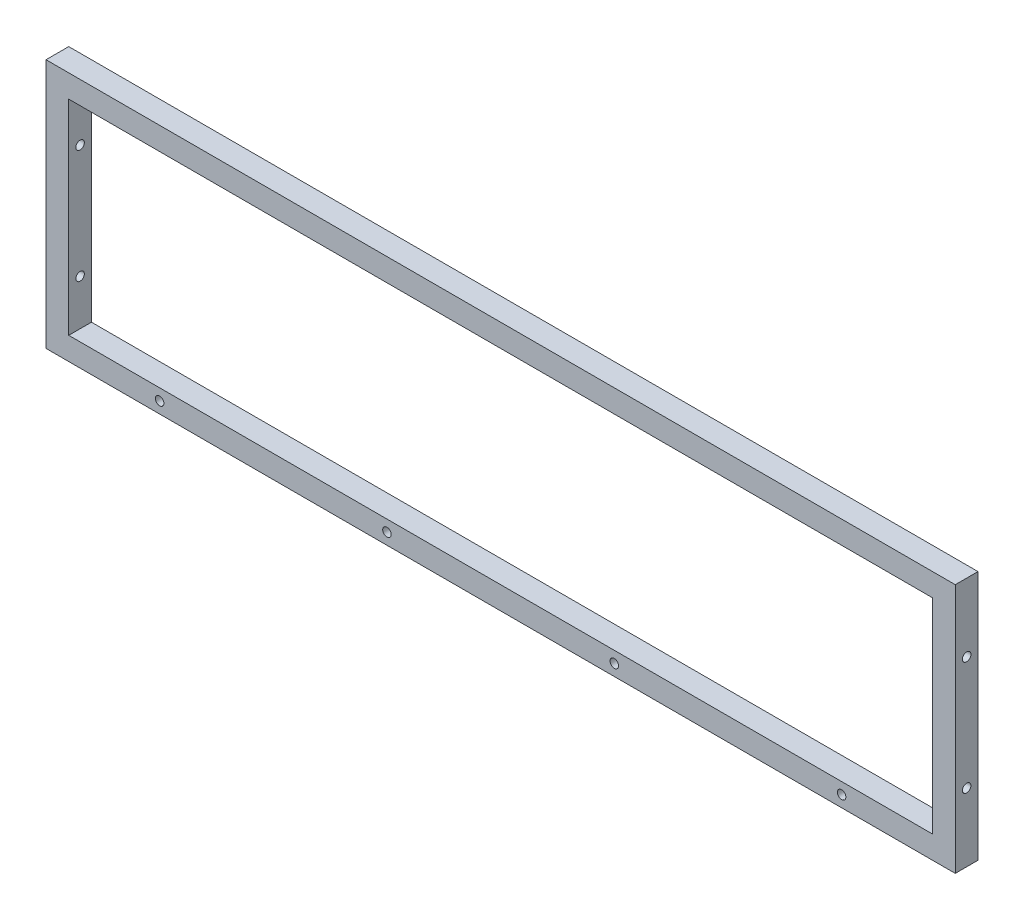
ISO-10303-21;
HEADER;
FILE_DESCRIPTION(('STEP AP214'),'2;1');
FILE_NAME('part.step','',(''),(''),'','','');
FILE_SCHEMA(('AUTOMOTIVE_DESIGN { 1 0 10303 214 1 1 1 1 }'));
ENDSEC;
DATA;
#1=APPLICATION_CONTEXT('core data for automotive mechanical design processes');
#2=APPLICATION_PROTOCOL_DEFINITION('international standard','automotive_design',2000,#1);
#3=PRODUCT_CONTEXT('',#1,'mechanical');
#4=PRODUCT('Part','Part','',(#3));
#5=PRODUCT_RELATED_PRODUCT_CATEGORY('part','',(#4));
#6=PRODUCT_DEFINITION_FORMATION('','',#4);
#7=PRODUCT_DEFINITION_CONTEXT('part definition',#1,'design');
#8=PRODUCT_DEFINITION('design','',#6,#7);
#9=PRODUCT_DEFINITION_SHAPE('','',#8);
#10=(LENGTH_UNIT() NAMED_UNIT(*) SI_UNIT(.MILLI.,.METRE.));
#11=(NAMED_UNIT(*) PLANE_ANGLE_UNIT() SI_UNIT($,.RADIAN.));
#12=(NAMED_UNIT(*) SI_UNIT($,.STERADIAN.) SOLID_ANGLE_UNIT());
#13=UNCERTAINTY_MEASURE_WITH_UNIT(LENGTH_MEASURE(1.E-05),#10,'distance_accuracy_value','');
#14=(GEOMETRIC_REPRESENTATION_CONTEXT(3) GLOBAL_UNCERTAINTY_ASSIGNED_CONTEXT((#13)) GLOBAL_UNIT_ASSIGNED_CONTEXT((#10,
#11,#12)) REPRESENTATION_CONTEXT('',''));
#15=CARTESIAN_POINT('',(0.,0.,0.));
#16=DIRECTION('',(0.,0.,1.));
#17=DIRECTION('',(1.,0.,0.));
#18=AXIS2_PLACEMENT_3D('',#15,#16,#17);
#19=CARTESIAN_POINT('',(0.,0.,25.4));
#20=DIRECTION('',(0.,0.,1.));
#21=DIRECTION('',(1.,0.,0.));
#22=AXIS2_PLACEMENT_3D('',#19,#20,#21);
#23=PLANE('',#22);
#24=CARTESIAN_POINT('',(381.,-127.,25.4));
#25=DIRECTION('',(0.,0.,1.));
#26=DIRECTION('',(1.,0.,0.));
#27=AXIS2_PLACEMENT_3D('',#24,#25,#26);
#28=CIRCLE('',#27,4.7625);
#29=CARTESIAN_POINT('',(385.7625,-127.,25.4));
#30=VERTEX_POINT('',#29);
#31=EDGE_CURVE('E171',#30,#30,#28,.T.);
#32=ORIENTED_EDGE('',*,*,#31,.F.);
#33=EDGE_LOOP('',(#32));
#34=FACE_BOUND('',#33,.T.);
#35=CARTESIAN_POINT('',(127.,-127.,25.4));
#36=DIRECTION('',(0.,0.,1.));
#37=DIRECTION('',(1.,0.,0.));
#38=AXIS2_PLACEMENT_3D('',#35,#36,#37);
#39=CIRCLE('',#38,4.76249999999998);
#40=CARTESIAN_POINT('',(131.7625,-127.,25.4));
#41=VERTEX_POINT('',#40);
#42=EDGE_CURVE('E189',#41,#41,#39,.T.);
#43=ORIENTED_EDGE('',*,*,#42,.F.);
#44=EDGE_LOOP('',(#43));
#45=FACE_BOUND('',#44,.T.);
#46=CARTESIAN_POINT('',(-381.,-127.,25.4));
#47=DIRECTION('',(0.,0.,1.));
#48=DIRECTION('',(1.,0.,0.));
#49=AXIS2_PLACEMENT_3D('',#46,#47,#48);
#50=CIRCLE('',#49,4.7625);
#51=CARTESIAN_POINT('',(-376.2375,-127.,25.4));
#52=VERTEX_POINT('',#51);
#53=EDGE_CURVE('E195',#52,#52,#50,.T.);
#54=ORIENTED_EDGE('',*,*,#53,.F.);
#55=EDGE_LOOP('',(#54));
#56=FACE_BOUND('',#55,.T.);
#57=CARTESIAN_POINT('',(-127.,-127.,25.4));
#58=DIRECTION('',(0.,0.,1.));
#59=DIRECTION('',(1.,0.,0.));
#60=AXIS2_PLACEMENT_3D('',#57,#58,#59);
#61=CIRCLE('',#60,4.76249999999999);
#62=CARTESIAN_POINT('',(-122.2375,-127.,25.4));
#63=VERTEX_POINT('',#62);
#64=EDGE_CURVE('E201',#63,#63,#61,.T.);
#65=ORIENTED_EDGE('',*,*,#64,.F.);
#66=EDGE_LOOP('',(#65));
#67=FACE_BOUND('',#66,.T.);
#68=DIRECTION('',(0.,-1.,0.));
#69=VECTOR('',#68,1.);
#70=CARTESIAN_POINT('',(-508.,-139.7,25.4));
#71=LINE('',#70,#69);
#72=CARTESIAN_POINT('',(-508.,139.7,25.4));
#73=VERTEX_POINT('',#72);
#74=CARTESIAN_POINT('',(-508.,-139.7,25.4));
#75=VERTEX_POINT('',#74);
#76=EDGE_CURVE('E140',#73,#75,#71,.T.);
#77=ORIENTED_EDGE('',*,*,#76,.T.);
#78=DIRECTION('',(1.,0.,0.));
#79=VECTOR('',#78,1.);
#80=CARTESIAN_POINT('',(508.,-139.7,25.4));
#81=LINE('',#80,#79);
#82=CARTESIAN_POINT('',(508.,-139.7,25.4));
#83=VERTEX_POINT('',#82);
#84=EDGE_CURVE('E143',#75,#83,#81,.T.);
#85=ORIENTED_EDGE('',*,*,#84,.T.);
#86=DIRECTION('',(0.,1.,0.));
#87=VECTOR('',#86,1.);
#88=CARTESIAN_POINT('',(508.,-139.7,25.4));
#89=LINE('',#88,#87);
#90=CARTESIAN_POINT('',(508.,139.7,25.4));
#91=VERTEX_POINT('',#90);
#92=EDGE_CURVE('E146',#83,#91,#89,.T.);
#93=ORIENTED_EDGE('',*,*,#92,.T.);
#94=DIRECTION('',(-1.,0.,0.));
#95=VECTOR('',#94,1.);
#96=CARTESIAN_POINT('',(508.,139.7,25.4));
#97=LINE('',#96,#95);
#98=EDGE_CURVE('E148',#91,#73,#97,.T.);
#99=ORIENTED_EDGE('',*,*,#98,.T.);
#100=EDGE_LOOP('',(#77,#85,#93,#99));
#101=FACE_BOUND('',#100,.T.);
#102=DIRECTION('',(1.,0.,0.));
#103=VECTOR('',#102,1.);
#104=CARTESIAN_POINT('',(482.6,-114.3,25.4));
#105=LINE('',#104,#103);
#106=CARTESIAN_POINT('',(-482.6,-114.3,25.4));
#107=VERTEX_POINT('',#106);
#108=CARTESIAN_POINT('',(482.6,-114.3,25.4));
#109=VERTEX_POINT('',#108);
#110=EDGE_CURVE('E110',#107,#109,#105,.T.);
#111=ORIENTED_EDGE('',*,*,#110,.F.);
#112=DIRECTION('',(0.,-1.,0.));
#113=VECTOR('',#112,1.);
#114=CARTESIAN_POINT('',(-482.6,-114.3,25.4));
#115=LINE('',#114,#113);
#116=CARTESIAN_POINT('',(-482.6,114.3,25.4));
#117=VERTEX_POINT('',#116);
#118=EDGE_CURVE('E102',#117,#107,#115,.T.);
#119=ORIENTED_EDGE('',*,*,#118,.F.);
#120=DIRECTION('',(-1.,0.,0.));
#121=VECTOR('',#120,1.);
#122=CARTESIAN_POINT('',(482.6,114.3,25.4));
#123=LINE('',#122,#121);
#124=CARTESIAN_POINT('',(482.6,114.3,25.4));
#125=VERTEX_POINT('',#124);
#126=EDGE_CURVE('E124',#125,#117,#123,.T.);
#127=ORIENTED_EDGE('',*,*,#126,.F.);
#128=DIRECTION('',(0.,1.,0.));
#129=VECTOR('',#128,1.);
#130=CARTESIAN_POINT('',(482.6,-114.3,25.4));
#131=LINE('',#130,#129);
#132=EDGE_CURVE('E122',#109,#125,#131,.T.);
#133=ORIENTED_EDGE('',*,*,#132,.F.);
#134=EDGE_LOOP('',(#111,#119,#127,#133));
#135=FACE_BOUND('',#134,.T.);
#136=ADVANCED_FACE('F35',(#34,#45,#56,#67,#101,#135),#23,.T.);
#137=CARTESIAN_POINT('',(0.,0.,0.));
#138=DIRECTION('',(0.,0.,1.));
#139=DIRECTION('',(1.,0.,0.));
#140=AXIS2_PLACEMENT_3D('',#137,#138,#139);
#141=PLANE('',#140);
#142=CARTESIAN_POINT('',(381.,-127.,0.));
#143=DIRECTION('',(0.,0.,1.));
#144=DIRECTION('',(1.,0.,0.));
#145=AXIS2_PLACEMENT_3D('',#142,#143,#144);
#146=CIRCLE('',#145,4.7625);
#147=CARTESIAN_POINT('',(385.7625,-127.,0.));
#148=VERTEX_POINT('',#147);
#149=EDGE_CURVE('E186',#148,#148,#146,.T.);
#150=ORIENTED_EDGE('',*,*,#149,.T.);
#151=EDGE_LOOP('',(#150));
#152=FACE_BOUND('',#151,.T.);
#153=CARTESIAN_POINT('',(127.,-127.,0.));
#154=DIRECTION('',(0.,0.,1.));
#155=DIRECTION('',(1.,0.,0.));
#156=AXIS2_PLACEMENT_3D('',#153,#154,#155);
#157=CIRCLE('',#156,4.7625);
#158=CARTESIAN_POINT('',(131.7625,-127.,0.));
#159=VERTEX_POINT('',#158);
#160=EDGE_CURVE('E192',#159,#159,#157,.T.);
#161=ORIENTED_EDGE('',*,*,#160,.T.);
#162=EDGE_LOOP('',(#161));
#163=FACE_BOUND('',#162,.T.);
#164=CARTESIAN_POINT('',(-381.,-127.,0.));
#165=DIRECTION('',(0.,0.,1.));
#166=DIRECTION('',(1.,0.,0.));
#167=AXIS2_PLACEMENT_3D('',#164,#165,#166);
#168=CIRCLE('',#167,4.7625);
#169=CARTESIAN_POINT('',(-376.2375,-127.,0.));
#170=VERTEX_POINT('',#169);
#171=EDGE_CURVE('E198',#170,#170,#168,.T.);
#172=ORIENTED_EDGE('',*,*,#171,.T.);
#173=EDGE_LOOP('',(#172));
#174=FACE_BOUND('',#173,.T.);
#175=CARTESIAN_POINT('',(-127.,-127.,0.));
#176=DIRECTION('',(0.,0.,1.));
#177=DIRECTION('',(1.,0.,0.));
#178=AXIS2_PLACEMENT_3D('',#175,#176,#177);
#179=CIRCLE('',#178,4.76249999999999);
#180=CARTESIAN_POINT('',(-122.2375,-127.,0.));
#181=VERTEX_POINT('',#180);
#182=EDGE_CURVE('E130',#181,#181,#179,.T.);
#183=ORIENTED_EDGE('',*,*,#182,.T.);
#184=EDGE_LOOP('',(#183));
#185=FACE_BOUND('',#184,.T.);
#186=DIRECTION('',(0.,-1.,0.));
#187=VECTOR('',#186,1.);
#188=CARTESIAN_POINT('',(-508.,-139.7,0.));
#189=LINE('',#188,#187);
#190=CARTESIAN_POINT('',(-508.,139.7,0.));
#191=VERTEX_POINT('',#190);
#192=CARTESIAN_POINT('',(-508.,-139.7,0.));
#193=VERTEX_POINT('',#192);
#194=EDGE_CURVE('E118',#191,#193,#189,.T.);
#195=ORIENTED_EDGE('',*,*,#194,.F.);
#196=DIRECTION('',(-1.,0.,0.));
#197=VECTOR('',#196,1.);
#198=CARTESIAN_POINT('',(508.,139.7,0.));
#199=LINE('',#198,#197);
#200=CARTESIAN_POINT('',(508.,139.7,0.));
#201=VERTEX_POINT('',#200);
#202=EDGE_CURVE('E144',#201,#191,#199,.T.);
#203=ORIENTED_EDGE('',*,*,#202,.F.);
#204=DIRECTION('',(0.,1.,0.));
#205=VECTOR('',#204,1.);
#206=CARTESIAN_POINT('',(508.,-139.7,0.));
#207=LINE('',#206,#205);
#208=CARTESIAN_POINT('',(508.,-139.7,0.));
#209=VERTEX_POINT('',#208);
#210=EDGE_CURVE('E155',#209,#201,#207,.T.);
#211=ORIENTED_EDGE('',*,*,#210,.F.);
#212=DIRECTION('',(1.,0.,0.));
#213=VECTOR('',#212,1.);
#214=CARTESIAN_POINT('',(508.,-139.7,0.));
#215=LINE('',#214,#213);
#216=EDGE_CURVE('E153',#193,#209,#215,.T.);
#217=ORIENTED_EDGE('',*,*,#216,.F.);
#218=EDGE_LOOP('',(#195,#203,#211,#217));
#219=FACE_BOUND('',#218,.T.);
#220=DIRECTION('',(0.,-1.,0.));
#221=VECTOR('',#220,1.);
#222=CARTESIAN_POINT('',(-482.6,-114.3,0.));
#223=LINE('',#222,#221);
#224=CARTESIAN_POINT('',(-482.6,114.3,0.));
#225=VERTEX_POINT('',#224);
#226=CARTESIAN_POINT('',(-482.6,-114.3,0.));
#227=VERTEX_POINT('',#226);
#228=EDGE_CURVE('E60',#225,#227,#223,.T.);
#229=ORIENTED_EDGE('',*,*,#228,.T.);
#230=DIRECTION('',(1.,0.,0.));
#231=VECTOR('',#230,1.);
#232=CARTESIAN_POINT('',(482.6,-114.3,0.));
#233=LINE('',#232,#231);
#234=CARTESIAN_POINT('',(482.6,-114.3,0.));
#235=VERTEX_POINT('',#234);
#236=EDGE_CURVE('E117',#227,#235,#233,.T.);
#237=ORIENTED_EDGE('',*,*,#236,.T.);
#238=DIRECTION('',(0.,1.,0.));
#239=VECTOR('',#238,1.);
#240=CARTESIAN_POINT('',(482.6,-114.3,0.));
#241=LINE('',#240,#239);
#242=CARTESIAN_POINT('',(482.6,114.3,0.));
#243=VERTEX_POINT('',#242);
#244=EDGE_CURVE('E132',#235,#243,#241,.T.);
#245=ORIENTED_EDGE('',*,*,#244,.T.);
#246=DIRECTION('',(-1.,0.,0.));
#247=VECTOR('',#246,1.);
#248=CARTESIAN_POINT('',(482.6,114.3,0.));
#249=LINE('',#248,#247);
#250=EDGE_CURVE('E111',#243,#225,#249,.T.);
#251=ORIENTED_EDGE('',*,*,#250,.T.);
#252=EDGE_LOOP('',(#229,#237,#245,#251));
#253=FACE_BOUND('',#252,.T.);
#254=ADVANCED_FACE('F206',(#152,#163,#174,#185,#219,#253),#141,.F.);
#255=CARTESIAN_POINT('',(-508.,-139.7,25.4));
#256=DIRECTION('',(1.,0.,0.));
#257=DIRECTION('',(0.,0.,-1.));
#258=AXIS2_PLACEMENT_3D('',#255,#256,#257);
#259=PLANE('',#258);
#260=CARTESIAN_POINT('',(-508.,-63.5,12.7));
#261=DIRECTION('',(1.,0.,0.));
#262=DIRECTION('',(0.,0.,1.));
#263=AXIS2_PLACEMENT_3D('',#260,#261,#262);
#264=CIRCLE('',#263,4.7625);
#265=CARTESIAN_POINT('',(-508.,-63.5,17.4625));
#266=VERTEX_POINT('',#265);
#267=EDGE_CURVE('E271',#266,#266,#264,.T.);
#268=ORIENTED_EDGE('',*,*,#267,.T.);
#269=EDGE_LOOP('',(#268));
#270=FACE_BOUND('',#269,.T.);
#271=CARTESIAN_POINT('',(-508.,63.5,12.7));
#272=DIRECTION('',(1.,0.,0.));
#273=DIRECTION('',(0.,0.,-1.));
#274=AXIS2_PLACEMENT_3D('',#271,#272,#273);
#275=CIRCLE('',#274,4.7625);
#276=CARTESIAN_POINT('',(-508.,63.5,7.93749999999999));
#277=VERTEX_POINT('',#276);
#278=EDGE_CURVE('E167',#277,#277,#275,.T.);
#279=ORIENTED_EDGE('',*,*,#278,.T.);
#280=EDGE_LOOP('',(#279));
#281=FACE_BOUND('',#280,.T.);
#282=ORIENTED_EDGE('',*,*,#194,.T.);
#283=DIRECTION('',(0.,0.,-1.));
#284=VECTOR('',#283,1.);
#285=CARTESIAN_POINT('',(-508.,-139.7,25.4));
#286=LINE('',#285,#284);
#287=EDGE_CURVE('E11',#75,#193,#286,.T.);
#288=ORIENTED_EDGE('',*,*,#287,.F.);
#289=ORIENTED_EDGE('',*,*,#76,.F.);
#290=DIRECTION('',(0.,0.,-1.));
#291=VECTOR('',#290,1.);
#292=CARTESIAN_POINT('',(-508.,139.7,25.4));
#293=LINE('',#292,#291);
#294=EDGE_CURVE('E150',#73,#191,#293,.T.);
#295=ORIENTED_EDGE('',*,*,#294,.T.);
#296=EDGE_LOOP('',(#282,#288,#289,#295));
#297=FACE_BOUND('',#296,.T.);
#298=ADVANCED_FACE('F37',(#270,#281,#297),#259,.F.);
#299=CARTESIAN_POINT('',(508.,-139.7,25.4));
#300=DIRECTION('',(0.,1.,0.));
#301=DIRECTION('',(-1.,0.,0.));
#302=AXIS2_PLACEMENT_3D('',#299,#300,#301);
#303=PLANE('',#302);
#304=ORIENTED_EDGE('',*,*,#216,.T.);
#305=DIRECTION('',(0.,0.,-1.));
#306=VECTOR('',#305,1.);
#307=CARTESIAN_POINT('',(508.,-139.7,25.4));
#308=LINE('',#307,#306);
#309=EDGE_CURVE('E44',#83,#209,#308,.T.);
#310=ORIENTED_EDGE('',*,*,#309,.F.);
#311=ORIENTED_EDGE('',*,*,#84,.F.);
#312=ORIENTED_EDGE('',*,*,#287,.T.);
#313=EDGE_LOOP('',(#304,#310,#311,#312));
#314=FACE_BOUND('',#313,.T.);
#315=ADVANCED_FACE('F229',(#314),#303,.F.);
#316=CARTESIAN_POINT('',(508.,-139.7,25.4));
#317=DIRECTION('',(-1.,0.,0.));
#318=DIRECTION('',(0.,0.,1.));
#319=AXIS2_PLACEMENT_3D('',#316,#317,#318);
#320=PLANE('',#319);
#321=CARTESIAN_POINT('',(508.,-63.5,12.7));
#322=DIRECTION('',(1.,0.,0.));
#323=DIRECTION('',(0.,0.,1.));
#324=AXIS2_PLACEMENT_3D('',#321,#322,#323);
#325=CIRCLE('',#324,4.7625);
#326=CARTESIAN_POINT('',(508.,-63.5,17.4625));
#327=VERTEX_POINT('',#326);
#328=EDGE_CURVE('E273',#327,#327,#325,.T.);
#329=ORIENTED_EDGE('',*,*,#328,.F.);
#330=EDGE_LOOP('',(#329));
#331=FACE_BOUND('',#330,.T.);
#332=CARTESIAN_POINT('',(508.,63.5,12.7));
#333=DIRECTION('',(1.,0.,0.));
#334=DIRECTION('',(0.,0.,-1.));
#335=AXIS2_PLACEMENT_3D('',#332,#333,#334);
#336=CIRCLE('',#335,4.7625);
#337=CARTESIAN_POINT('',(508.,63.5,7.93749999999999));
#338=VERTEX_POINT('',#337);
#339=EDGE_CURVE('E174',#338,#338,#336,.T.);
#340=ORIENTED_EDGE('',*,*,#339,.F.);
#341=EDGE_LOOP('',(#340));
#342=FACE_BOUND('',#341,.T.);
#343=ORIENTED_EDGE('',*,*,#210,.T.);
#344=DIRECTION('',(0.,0.,-1.));
#345=VECTOR('',#344,1.);
#346=CARTESIAN_POINT('',(508.,139.7,25.4));
#347=LINE('',#346,#345);
#348=EDGE_CURVE('E160',#91,#201,#347,.T.);
#349=ORIENTED_EDGE('',*,*,#348,.F.);
#350=ORIENTED_EDGE('',*,*,#92,.F.);
#351=ORIENTED_EDGE('',*,*,#309,.T.);
#352=EDGE_LOOP('',(#343,#349,#350,#351));
#353=FACE_BOUND('',#352,.T.);
#354=ADVANCED_FACE('F234',(#331,#342,#353),#320,.F.);
#355=CARTESIAN_POINT('',(508.,139.7,25.4));
#356=DIRECTION('',(0.,-1.,0.));
#357=DIRECTION('',(1.,0.,0.));
#358=AXIS2_PLACEMENT_3D('',#355,#356,#357);
#359=PLANE('',#358);
#360=ORIENTED_EDGE('',*,*,#202,.T.);
#361=ORIENTED_EDGE('',*,*,#294,.F.);
#362=ORIENTED_EDGE('',*,*,#98,.F.);
#363=ORIENTED_EDGE('',*,*,#348,.T.);
#364=EDGE_LOOP('',(#360,#361,#362,#363));
#365=FACE_BOUND('',#364,.T.);
#366=ADVANCED_FACE('F237',(#365),#359,.F.);
#367=CARTESIAN_POINT('',(-482.6,-114.3,25.4));
#368=DIRECTION('',(1.,0.,0.));
#369=DIRECTION('',(0.,0.,-1.));
#370=AXIS2_PLACEMENT_3D('',#367,#368,#369);
#371=PLANE('',#370);
#372=CARTESIAN_POINT('',(-482.6,-63.5,12.7));
#373=DIRECTION('',(1.,0.,0.));
#374=DIRECTION('',(0.,0.,-1.));
#375=AXIS2_PLACEMENT_3D('',#372,#373,#374);
#376=CIRCLE('',#375,4.7625);
#377=CARTESIAN_POINT('',(-482.6,-63.5,7.93750000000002));
#378=VERTEX_POINT('',#377);
#379=EDGE_CURVE('E179',#378,#378,#376,.T.);
#380=ORIENTED_EDGE('',*,*,#379,.F.);
#381=EDGE_LOOP('',(#380));
#382=FACE_BOUND('',#381,.T.);
#383=CARTESIAN_POINT('',(-482.6,63.5,12.7));
#384=DIRECTION('',(1.,0.,0.));
#385=DIRECTION('',(0.,0.,-1.));
#386=AXIS2_PLACEMENT_3D('',#383,#384,#385);
#387=CIRCLE('',#386,4.7625);
#388=CARTESIAN_POINT('',(-482.6,63.5,7.93749999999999));
#389=VERTEX_POINT('',#388);
#390=EDGE_CURVE('E166',#389,#389,#387,.T.);
#391=ORIENTED_EDGE('',*,*,#390,.F.);
#392=EDGE_LOOP('',(#391));
#393=FACE_BOUND('',#392,.T.);
#394=ORIENTED_EDGE('',*,*,#228,.F.);
#395=DIRECTION('',(0.,0.,-1.));
#396=VECTOR('',#395,1.);
#397=CARTESIAN_POINT('',(-482.6,114.3,25.4));
#398=LINE('',#397,#396);
#399=EDGE_CURVE('E106',#117,#225,#398,.T.);
#400=ORIENTED_EDGE('',*,*,#399,.F.);
#401=ORIENTED_EDGE('',*,*,#118,.T.);
#402=DIRECTION('',(0.,0.,-1.));
#403=VECTOR('',#402,1.);
#404=CARTESIAN_POINT('',(-482.6,-114.3,25.4));
#405=LINE('',#404,#403);
#406=EDGE_CURVE('E105',#107,#227,#405,.T.);
#407=ORIENTED_EDGE('',*,*,#406,.T.);
#408=EDGE_LOOP('',(#394,#400,#401,#407));
#409=FACE_BOUND('',#408,.T.);
#410=ADVANCED_FACE('F104',(#382,#393,#409),#371,.T.);
#411=CARTESIAN_POINT('',(482.6,-114.3,25.4));
#412=DIRECTION('',(0.,1.,0.));
#413=DIRECTION('',(-1.,0.,0.));
#414=AXIS2_PLACEMENT_3D('',#411,#412,#413);
#415=PLANE('',#414);
#416=ORIENTED_EDGE('',*,*,#236,.F.);
#417=ORIENTED_EDGE('',*,*,#406,.F.);
#418=ORIENTED_EDGE('',*,*,#110,.T.);
#419=DIRECTION('',(0.,0.,-1.));
#420=VECTOR('',#419,1.);
#421=CARTESIAN_POINT('',(482.6,-114.3,25.4));
#422=LINE('',#421,#420);
#423=EDGE_CURVE('E119',#109,#235,#422,.T.);
#424=ORIENTED_EDGE('',*,*,#423,.T.);
#425=EDGE_LOOP('',(#416,#417,#418,#424));
#426=FACE_BOUND('',#425,.T.);
#427=ADVANCED_FACE('F114',(#426),#415,.T.);
#428=CARTESIAN_POINT('',(482.6,-114.3,25.4));
#429=DIRECTION('',(-1.,0.,0.));
#430=DIRECTION('',(0.,0.,1.));
#431=AXIS2_PLACEMENT_3D('',#428,#429,#430);
#432=PLANE('',#431);
#433=CARTESIAN_POINT('',(482.6,-63.5,12.7));
#434=DIRECTION('',(-1.,0.,0.));
#435=DIRECTION('',(0.,0.,1.));
#436=AXIS2_PLACEMENT_3D('',#433,#434,#435);
#437=CIRCLE('',#436,4.7625);
#438=CARTESIAN_POINT('',(482.6,-63.5,17.4625));
#439=VERTEX_POINT('',#438);
#440=EDGE_CURVE('E39',#439,#439,#437,.T.);
#441=ORIENTED_EDGE('',*,*,#440,.F.);
#442=EDGE_LOOP('',(#441));
#443=FACE_BOUND('',#442,.T.);
#444=CARTESIAN_POINT('',(482.6,63.5,12.7));
#445=DIRECTION('',(-1.,0.,0.));
#446=DIRECTION('',(0.,0.,1.));
#447=AXIS2_PLACEMENT_3D('',#444,#445,#446);
#448=CIRCLE('',#447,4.7625);
#449=CARTESIAN_POINT('',(482.6,63.5,17.4625));
#450=VERTEX_POINT('',#449);
#451=EDGE_CURVE('E164',#450,#450,#448,.T.);
#452=ORIENTED_EDGE('',*,*,#451,.F.);
#453=EDGE_LOOP('',(#452));
#454=FACE_BOUND('',#453,.T.);
#455=ORIENTED_EDGE('',*,*,#244,.F.);
#456=ORIENTED_EDGE('',*,*,#423,.F.);
#457=ORIENTED_EDGE('',*,*,#132,.T.);
#458=DIRECTION('',(0.,0.,-1.));
#459=VECTOR('',#458,1.);
#460=CARTESIAN_POINT('',(482.6,114.3,25.4));
#461=LINE('',#460,#459);
#462=EDGE_CURVE('E52',#125,#243,#461,.T.);
#463=ORIENTED_EDGE('',*,*,#462,.T.);
#464=EDGE_LOOP('',(#455,#456,#457,#463));
#465=FACE_BOUND('',#464,.T.);
#466=ADVANCED_FACE('F244',(#443,#454,#465),#432,.T.);
#467=CARTESIAN_POINT('',(482.6,114.3,25.4));
#468=DIRECTION('',(0.,-1.,0.));
#469=DIRECTION('',(1.,0.,0.));
#470=AXIS2_PLACEMENT_3D('',#467,#468,#469);
#471=PLANE('',#470);
#472=ORIENTED_EDGE('',*,*,#250,.F.);
#473=ORIENTED_EDGE('',*,*,#462,.F.);
#474=ORIENTED_EDGE('',*,*,#126,.T.);
#475=ORIENTED_EDGE('',*,*,#399,.T.);
#476=EDGE_LOOP('',(#472,#473,#474,#475));
#477=FACE_BOUND('',#476,.T.);
#478=ADVANCED_FACE('F213',(#477),#471,.T.);
#479=CARTESIAN_POINT('',(-127.,-127.,25.4));
#480=DIRECTION('',(0.,0.,1.));
#481=DIRECTION('',(1.,0.,0.));
#482=AXIS2_PLACEMENT_3D('',#479,#480,#481);
#483=CYLINDRICAL_SURFACE('',#482,4.76249999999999);
#484=ORIENTED_EDGE('',*,*,#182,.F.);
#485=EDGE_LOOP('',(#484));
#486=FACE_BOUND('',#485,.T.);
#487=ORIENTED_EDGE('',*,*,#64,.T.);
#488=EDGE_LOOP('',(#487));
#489=FACE_BOUND('',#488,.T.);
#490=ADVANCED_FACE('F209',(#486,#489),#483,.F.);
#491=CARTESIAN_POINT('',(-381.,-127.,25.4));
#492=DIRECTION('',(0.,0.,1.));
#493=DIRECTION('',(1.,0.,0.));
#494=AXIS2_PLACEMENT_3D('',#491,#492,#493);
#495=CYLINDRICAL_SURFACE('',#494,4.7625);
#496=ORIENTED_EDGE('',*,*,#171,.F.);
#497=EDGE_LOOP('',(#496));
#498=FACE_BOUND('',#497,.T.);
#499=ORIENTED_EDGE('',*,*,#53,.T.);
#500=EDGE_LOOP('',(#499));
#501=FACE_BOUND('',#500,.T.);
#502=ADVANCED_FACE('F212',(#498,#501),#495,.F.);
#503=CARTESIAN_POINT('',(127.,-127.,25.4));
#504=DIRECTION('',(0.,0.,1.));
#505=DIRECTION('',(1.,0.,0.));
#506=AXIS2_PLACEMENT_3D('',#503,#504,#505);
#507=CYLINDRICAL_SURFACE('',#506,4.76249999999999);
#508=ORIENTED_EDGE('',*,*,#160,.F.);
#509=EDGE_LOOP('',(#508));
#510=FACE_BOUND('',#509,.T.);
#511=ORIENTED_EDGE('',*,*,#42,.T.);
#512=EDGE_LOOP('',(#511));
#513=FACE_BOUND('',#512,.T.);
#514=ADVANCED_FACE('F293',(#510,#513),#507,.F.);
#515=CARTESIAN_POINT('',(381.,-127.,25.4));
#516=DIRECTION('',(0.,0.,1.));
#517=DIRECTION('',(1.,0.,0.));
#518=AXIS2_PLACEMENT_3D('',#515,#516,#517);
#519=CYLINDRICAL_SURFACE('',#518,4.7625);
#520=ORIENTED_EDGE('',*,*,#149,.F.);
#521=EDGE_LOOP('',(#520));
#522=FACE_BOUND('',#521,.T.);
#523=ORIENTED_EDGE('',*,*,#31,.T.);
#524=EDGE_LOOP('',(#523));
#525=FACE_BOUND('',#524,.T.);
#526=ADVANCED_FACE('F286',(#522,#525),#519,.F.);
#527=CARTESIAN_POINT('',(-508.,63.5,12.7));
#528=DIRECTION('',(1.,0.,0.));
#529=DIRECTION('',(0.,0.,-1.));
#530=AXIS2_PLACEMENT_3D('',#527,#528,#529);
#531=CYLINDRICAL_SURFACE('',#530,4.7625);
#532=ORIENTED_EDGE('',*,*,#451,.T.);
#533=EDGE_LOOP('',(#532));
#534=FACE_BOUND('',#533,.T.);
#535=ORIENTED_EDGE('',*,*,#339,.T.);
#536=EDGE_LOOP('',(#535));
#537=FACE_BOUND('',#536,.T.);
#538=ADVANCED_FACE('F283',(#534,#537),#531,.F.);
#539=ORIENTED_EDGE('',*,*,#390,.T.);
#540=EDGE_LOOP('',(#539));
#541=FACE_BOUND('',#540,.T.);
#542=ORIENTED_EDGE('',*,*,#278,.F.);
#543=EDGE_LOOP('',(#542));
#544=FACE_BOUND('',#543,.T.);
#545=ADVANCED_FACE('F285',(#541,#544),#531,.F.);
#546=CARTESIAN_POINT('',(-508.,-63.5,12.7));
#547=DIRECTION('',(1.,0.,0.));
#548=DIRECTION('',(0.,0.,-1.));
#549=AXIS2_PLACEMENT_3D('',#546,#547,#548);
#550=CYLINDRICAL_SURFACE('',#549,4.7625);
#551=ORIENTED_EDGE('',*,*,#440,.T.);
#552=EDGE_LOOP('',(#551));
#553=FACE_BOUND('',#552,.T.);
#554=ORIENTED_EDGE('',*,*,#328,.T.);
#555=EDGE_LOOP('',(#554));
#556=FACE_BOUND('',#555,.T.);
#557=ADVANCED_FACE('F279',(#553,#556),#550,.F.);
#558=ORIENTED_EDGE('',*,*,#379,.T.);
#559=EDGE_LOOP('',(#558));
#560=FACE_BOUND('',#559,.T.);
#561=ORIENTED_EDGE('',*,*,#267,.F.);
#562=EDGE_LOOP('',(#561));
#563=FACE_BOUND('',#562,.T.);
#564=ADVANCED_FACE('F381',(#560,#563),#550,.F.);
#565=CLOSED_SHELL('',(#136,#254,#298,#315,#354,#366,#410,#427,#466,#478,#490,#502,#514,#526,
#538,#545,#557,#564));
#566=MANIFOLD_SOLID_BREP('B2',#565);
#567=ADVANCED_BREP_SHAPE_REPRESENTATION('',(#18,#566),#14);
#568=SHAPE_DEFINITION_REPRESENTATION(#9,#567);
ENDSEC;
END-ISO-10303-21;
